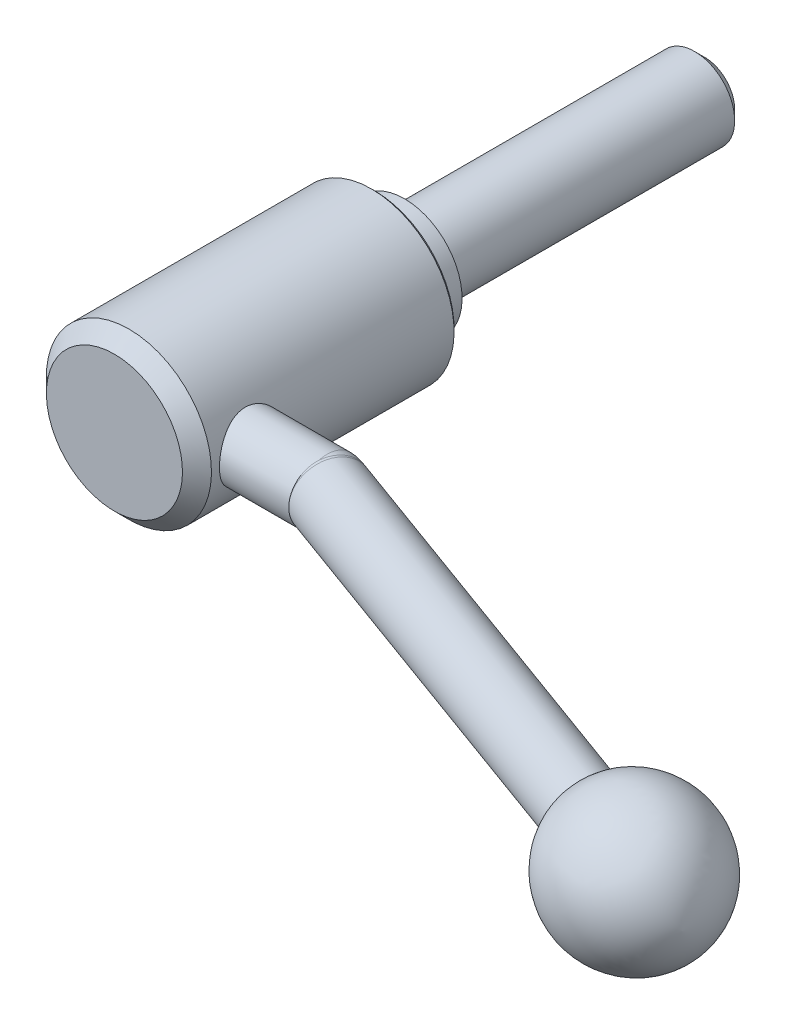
ISO-10303-21;
HEADER;
FILE_DESCRIPTION(('STEP AP214'),'2;1');
FILE_NAME('part.step','',(''),(''),'','','');
FILE_SCHEMA(('AUTOMOTIVE_DESIGN { 1 0 10303 214 1 1 1 1 }'));
ENDSEC;
DATA;
#1=APPLICATION_CONTEXT('core data for automotive mechanical design processes');
#2=APPLICATION_PROTOCOL_DEFINITION('international standard','automotive_design',2000,#1);
#3=PRODUCT_CONTEXT('',#1,'mechanical');
#4=PRODUCT('Part','Part','',(#3));
#5=PRODUCT_RELATED_PRODUCT_CATEGORY('part','',(#4));
#6=PRODUCT_DEFINITION_FORMATION('','',#4);
#7=PRODUCT_DEFINITION_CONTEXT('part definition',#1,'design');
#8=PRODUCT_DEFINITION('design','',#6,#7);
#9=PRODUCT_DEFINITION_SHAPE('','',#8);
#10=(LENGTH_UNIT() NAMED_UNIT(*) SI_UNIT(.MILLI.,.METRE.));
#11=(NAMED_UNIT(*) PLANE_ANGLE_UNIT() SI_UNIT($,.RADIAN.));
#12=(NAMED_UNIT(*) SI_UNIT($,.STERADIAN.) SOLID_ANGLE_UNIT());
#13=UNCERTAINTY_MEASURE_WITH_UNIT(LENGTH_MEASURE(1.E-05),#10,'distance_accuracy_value','');
#14=(GEOMETRIC_REPRESENTATION_CONTEXT(3) GLOBAL_UNCERTAINTY_ASSIGNED_CONTEXT((#13)) GLOBAL_UNIT_ASSIGNED_CONTEXT((#10,
#11,#12)) REPRESENTATION_CONTEXT('',''));
#15=CARTESIAN_POINT('',(0.,0.,0.));
#16=DIRECTION('',(0.,0.,1.));
#17=DIRECTION('',(1.,0.,0.));
#18=AXIS2_PLACEMENT_3D('',#15,#16,#17);
#19=CARTESIAN_POINT('',(0.,0.,0.));
#20=DIRECTION('',(0.,0.,-1.));
#21=DIRECTION('',(0.,1.,0.));
#22=AXIS2_PLACEMENT_3D('',#19,#20,#21);
#23=CYLINDRICAL_SURFACE('',#22,16.5);
#24=CARTESIAN_POINT('',(0.,0.,6.6));
#25=DIRECTION('',(0.,0.,-1.));
#26=DIRECTION('',(0.,1.,0.));
#27=AXIS2_PLACEMENT_3D('',#24,#25,#26);
#28=CIRCLE('',#27,16.5);
#29=CARTESIAN_POINT('',(0.,16.5,6.6));
#30=VERTEX_POINT('',#29);
#31=EDGE_CURVE('E147',#30,#30,#28,.T.);
#32=ORIENTED_EDGE('',*,*,#31,.F.);
#33=EDGE_LOOP('',(#32));
#34=FACE_BOUND('',#33,.T.);
#35=CARTESIAN_POINT('',(15.1657508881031,6.5,47.));
#36=CARTESIAN_POINT('',(15.1657521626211,6.49999870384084,47.1744094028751));
#37=CARTESIAN_POINT('',(15.1687696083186,6.49297069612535,47.3488754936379));
#38=CARTESIAN_POINT('',(15.180743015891,6.4649258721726,47.6965510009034));
#39=CARTESIAN_POINT('',(15.1897026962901,6.44390029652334,47.8697595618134));
#40=CARTESIAN_POINT('',(15.2132851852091,6.38802582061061,48.2139084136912));
#41=CARTESIAN_POINT('',(15.2279195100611,6.35314880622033,48.3848433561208));
#42=CARTESIAN_POINT('',(15.2623783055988,6.26991497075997,48.722930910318));
#43=CARTESIAN_POINT('',(15.2822049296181,6.22155255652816,48.890081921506));
#44=CARTESIAN_POINT('',(15.3263305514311,6.11204204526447,49.2187433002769));
#45=CARTESIAN_POINT('',(15.3506106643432,6.05094779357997,49.3802741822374));
#46=CARTESIAN_POINT('',(15.4029879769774,5.91634808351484,49.6975038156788));
#47=CARTESIAN_POINT('',(15.4310866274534,5.84283790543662,49.8532003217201));
#48=CARTESIAN_POINT('',(15.4902847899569,5.68403460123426,50.1577239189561));
#49=CARTESIAN_POINT('',(15.521382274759,5.59874941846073,50.3065555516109));
#50=CARTESIAN_POINT('',(15.5857773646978,5.41690395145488,50.5967321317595));
#51=CARTESIAN_POINT('',(15.6190757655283,5.32033957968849,50.7380743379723));
#52=CARTESIAN_POINT('',(15.6887204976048,5.11143504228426,51.0193834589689));
#53=CARTESIAN_POINT('',(15.7251359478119,4.99854682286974,51.1589265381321));
#54=CARTESIAN_POINT('',(15.7984684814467,4.76169722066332,51.4281356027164));
#55=CARTESIAN_POINT('',(15.8353855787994,4.6377355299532,51.5578013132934));
#56=CARTESIAN_POINT('',(15.9087724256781,4.37938333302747,51.8065762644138));
#57=CARTESIAN_POINT('',(15.9452419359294,4.24498750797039,51.9256800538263));
#58=CARTESIAN_POINT('',(16.0167582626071,3.96662276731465,52.1524872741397));
#59=CARTESIAN_POINT('',(16.0518055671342,3.82265718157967,52.2601946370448));
#60=CARTESIAN_POINT('',(16.1208941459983,3.52019152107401,52.467462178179));
#61=CARTESIAN_POINT('',(16.1548445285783,3.3613450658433,52.5665481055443));
#62=CARTESIAN_POINT('',(16.2192807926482,3.03521726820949,52.7508716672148));
#63=CARTESIAN_POINT('',(16.2497679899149,2.86793916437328,52.8361145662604));
#64=CARTESIAN_POINT('',(16.306415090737,2.52603369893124,52.9920322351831));
#65=CARTESIAN_POINT('',(16.3325754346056,2.35140708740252,53.062708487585));
#66=CARTESIAN_POINT('',(16.3798001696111,1.99606140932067,53.1888023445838));
#67=CARTESIAN_POINT('',(16.4008648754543,1.81534271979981,53.2442208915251));
#68=CARTESIAN_POINT('',(16.4364052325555,1.45784632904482,53.3369679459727));
#69=CARTESIAN_POINT('',(16.4511444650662,1.28128382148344,53.3750254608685));
#70=CARTESIAN_POINT('',(16.4750042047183,0.925236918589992,53.4363470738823));
#71=CARTESIAN_POINT('',(16.4841250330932,0.745752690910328,53.4596120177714));
#72=CARTESIAN_POINT('',(16.4964855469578,0.38532015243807,53.4910896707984));
#73=CARTESIAN_POINT('',(16.4997269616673,0.204372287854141,53.4993068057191));
#74=CARTESIAN_POINT('',(16.5002398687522,-0.157583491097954,53.500608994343));
#75=CARTESIAN_POINT('',(16.4975115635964,-0.33859140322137,53.4936945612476));
#76=CARTESIAN_POINT('',(16.4864766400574,-0.689328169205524,53.465606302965));
#77=CARTESIAN_POINT('',(16.4784837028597,-0.85913183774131,53.4452341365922));
#78=CARTESIAN_POINT('',(16.4574384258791,-1.19635679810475,53.3912360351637));
#79=CARTESIAN_POINT('',(16.444384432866,-1.36377729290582,53.3576057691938));
#80=CARTESIAN_POINT('',(16.4135516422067,-1.69498665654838,53.2774234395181));
#81=CARTESIAN_POINT('',(16.3957743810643,-1.85877668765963,53.2308755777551));
#82=CARTESIAN_POINT('',(16.3559249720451,-2.18179127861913,53.1252488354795));
#83=CARTESIAN_POINT('',(16.3338511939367,-2.34101407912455,53.0661651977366));
#84=CARTESIAN_POINT('',(16.2855961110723,-2.65615140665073,52.9350157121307));
#85=CARTESIAN_POINT('',(16.2593596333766,-2.81198390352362,52.8627732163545));
#86=CARTESIAN_POINT('',(16.2036445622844,-3.11704287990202,52.7064377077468));
#87=CARTESIAN_POINT('',(16.1741648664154,-3.26626708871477,52.6223406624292));
#88=CARTESIAN_POINT('',(16.1126670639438,-3.55725721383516,52.4428984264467));
#89=CARTESIAN_POINT('',(16.0806487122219,-3.69902240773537,52.3475521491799));
#90=CARTESIAN_POINT('',(16.0148235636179,-3.97435099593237,52.1462241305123));
#91=CARTESIAN_POINT('',(15.9810166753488,-4.10791397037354,52.0402418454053));
#92=CARTESIAN_POINT('',(15.9101988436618,-4.37444690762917,51.8111373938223));
#93=CARTESIAN_POINT('',(15.8731214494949,-4.50682971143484,51.687351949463));
#94=CARTESIAN_POINT('',(15.7988232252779,-4.76074389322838,51.4292307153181));
#95=CARTESIAN_POINT('',(15.7616024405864,-4.88227844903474,51.2948980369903));
#96=CARTESIAN_POINT('',(15.6879834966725,-5.11389804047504,51.0163266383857));
#97=CARTESIAN_POINT('',(15.6515859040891,-5.22397536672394,50.8720813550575));
#98=CARTESIAN_POINT('',(15.5806672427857,-5.43183822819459,50.5746385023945));
#99=CARTESIAN_POINT('',(15.5461454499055,-5.52962852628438,50.4214444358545));
#100=CARTESIAN_POINT('',(15.4790662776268,-5.71475871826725,50.1026478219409));
#101=CARTESIAN_POINT('',(15.4465879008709,-5.80174188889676,49.936821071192));
#102=CARTESIAN_POINT('',(15.3857195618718,-5.96128563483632,49.5977234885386));
#103=CARTESIAN_POINT('',(15.3573279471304,-6.03385204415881,49.4244557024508));
#104=CARTESIAN_POINT('',(15.3055990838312,-6.16388979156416,49.0716641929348));
#105=CARTESIAN_POINT('',(15.2822603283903,-6.22136563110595,48.8921423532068));
#106=CARTESIAN_POINT('',(15.2414756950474,-6.32062540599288,48.5281589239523));
#107=CARTESIAN_POINT('',(15.2240293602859,-6.36241055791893,48.3436977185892));
#108=CARTESIAN_POINT('',(15.1965377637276,-6.42778493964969,47.9824635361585));
#109=CARTESIAN_POINT('',(15.1861129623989,-6.45231123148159,47.8058886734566));
#110=CARTESIAN_POINT('',(15.1714222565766,-6.48677897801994,47.4510697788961));
#111=CARTESIAN_POINT('',(15.1671560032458,-6.4967212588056,47.2728258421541));
#112=CARTESIAN_POINT('',(15.1649343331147,-6.5019054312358,46.9161296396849));
#113=CARTESIAN_POINT('',(15.1669773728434,-6.49715091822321,46.7376774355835));
#114=CARTESIAN_POINT('',(15.1772980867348,-6.47300508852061,46.3819515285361));
#115=CARTESIAN_POINT('',(15.1855756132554,-6.45361411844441,46.2046777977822));
#116=CARTESIAN_POINT('',(15.2074545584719,-6.40187966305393,45.8623519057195));
#117=CARTESIAN_POINT('',(15.2207392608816,-6.37030447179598,45.6971624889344));
#118=CARTESIAN_POINT('',(15.2522135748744,-6.29457395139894,45.3701161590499));
#119=CARTESIAN_POINT('',(15.2704047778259,-6.25041454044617,45.2082603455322));
#120=CARTESIAN_POINT('',(15.3111508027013,-6.1499265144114,44.8889788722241));
#121=CARTESIAN_POINT('',(15.3337047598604,-6.09360031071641,44.7315523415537));
#122=CARTESIAN_POINT('',(15.3825547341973,-5.9692104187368,44.4219440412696));
#123=CARTESIAN_POINT('',(15.4088521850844,-5.90114223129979,44.2697643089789));
#124=CARTESIAN_POINT('',(15.4655807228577,-5.75087055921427,43.9656332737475));
#125=CARTESIAN_POINT('',(15.496133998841,-5.66821518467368,43.8139280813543));
#126=CARTESIAN_POINT('',(15.5596953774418,-5.4913305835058,43.5178983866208));
#127=CARTESIAN_POINT('',(15.5927043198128,-5.39709739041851,43.373576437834));
#128=CARTESIAN_POINT('',(15.6603145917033,-5.19765644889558,43.093084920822));
#129=CARTESIAN_POINT('',(15.6949161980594,-5.09244678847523,42.9569167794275));
#130=CARTESIAN_POINT('',(15.7648419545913,-4.87166967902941,42.6934495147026));
#131=CARTESIAN_POINT('',(15.8001661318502,-4.75610184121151,42.5661507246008));
#132=CARTESIAN_POINT('',(15.8732028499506,-4.50660710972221,42.3123157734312));
#133=CARTESIAN_POINT('',(15.910905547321,-4.37195833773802,42.1864851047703));
#134=CARTESIAN_POINT('',(15.985112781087,-4.09232041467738,41.9466012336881));
#135=CARTESIAN_POINT('',(16.0216176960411,-3.94733457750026,41.8325442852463));
#136=CARTESIAN_POINT('',(16.0924669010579,-3.64776716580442,41.6168903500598));
#137=CARTESIAN_POINT('',(16.1268102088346,-3.4931812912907,41.5152990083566));
#138=CARTESIAN_POINT('',(16.192362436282,-3.17548270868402,41.3254483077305));
#139=CARTESIAN_POINT('',(16.2235726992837,-3.01237370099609,41.2371832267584));
#140=CARTESIAN_POINT('',(16.2819868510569,-2.67872446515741,41.0747287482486));
#141=CARTESIAN_POINT('',(16.3091932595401,-2.50818899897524,41.0005304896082));
#142=CARTESIAN_POINT('',(16.3588360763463,-2.16084294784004,40.8668630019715));
#143=CARTESIAN_POINT('',(16.3812744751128,-1.98403501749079,40.8073876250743));
#144=CARTESIAN_POINT('',(16.4207336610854,-1.62543340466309,40.7037478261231));
#145=CARTESIAN_POINT('',(16.4377556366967,-1.44364082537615,40.6595800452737));
#146=CARTESIAN_POINT('',(16.4658759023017,-1.0764844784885,40.5870294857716));
#147=CARTESIAN_POINT('',(16.4769745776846,-0.89112094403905,40.5586456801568));
#148=CARTESIAN_POINT('',(16.4924035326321,-0.530232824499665,40.5192842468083));
#149=CARTESIAN_POINT('',(16.4971193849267,-0.354832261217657,40.5073144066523));
#150=CARTESIAN_POINT('',(16.5009342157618,-0.003578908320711,40.4976272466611));
#151=CARTESIAN_POINT('',(16.5000333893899,0.172273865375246,40.4999094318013));
#152=CARTESIAN_POINT('',(16.492639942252,0.523072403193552,40.5187002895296));
#153=CARTESIAN_POINT('',(16.4861480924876,0.698018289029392,40.5352070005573));
#154=CARTESIAN_POINT('',(16.4677497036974,1.04571908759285,40.5822707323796));
#155=CARTESIAN_POINT('',(16.4558431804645,1.21847400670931,40.6128277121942));
#156=CARTESIAN_POINT('',(16.427359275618,1.55551611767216,40.6865815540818));
#157=CARTESIAN_POINT('',(16.4109292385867,1.71990302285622,40.7293811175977));
#158=CARTESIAN_POINT('',(16.3736686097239,2.04442213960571,40.8275543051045));
#159=CARTESIAN_POINT('',(16.3528365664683,2.20455292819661,40.8829320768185));
#160=CARTESIAN_POINT('',(16.3072831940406,2.51948953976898,41.0057747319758));
#161=CARTESIAN_POINT('',(16.2825627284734,2.67429653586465,41.0732369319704));
#162=CARTESIAN_POINT('',(16.2298017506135,2.977796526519,41.2197632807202));
#163=CARTESIAN_POINT('',(16.201759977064,3.12648716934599,41.2988318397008));
#164=CARTESIAN_POINT('',(16.1417339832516,3.42320288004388,41.4716706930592));
#165=CARTESIAN_POINT('',(16.1096315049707,3.5709192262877,41.565929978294));
#166=CARTESIAN_POINT('',(16.0433028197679,3.85799821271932,41.7658374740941));
#167=CARTESIAN_POINT('',(16.0090758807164,3.99735794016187,41.8714896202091));
#168=CARTESIAN_POINT('',(15.9393375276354,4.266955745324,42.0935156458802));
#169=CARTESIAN_POINT('',(15.9038258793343,4.39719214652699,42.2098914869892));
#170=CARTESIAN_POINT('',(15.8323930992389,4.647828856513,42.4526787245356));
#171=CARTESIAN_POINT('',(15.796471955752,4.76822888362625,42.5790904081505));
#172=CARTESIAN_POINT('',(15.7229728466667,5.00544246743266,42.8491269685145));
#173=CARTESIAN_POINT('',(15.6854245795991,5.12160881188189,42.9933293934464));
#174=CARTESIAN_POINT('',(15.6119611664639,5.34135661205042,43.2913381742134));
#175=CARTESIAN_POINT('',(15.5760454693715,5.44494233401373,43.4451412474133));
#176=CARTESIAN_POINT('',(15.5068861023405,5.63889116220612,43.76158008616));
#177=CARTESIAN_POINT('',(15.4736440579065,5.72924625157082,43.9242211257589));
#178=CARTESIAN_POINT('',(15.4109193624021,5.89588782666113,44.2571658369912));
#179=CARTESIAN_POINT('',(15.3814348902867,5.9721811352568,44.427465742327));
#180=CARTESIAN_POINT('',(15.3295715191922,6.10399903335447,44.7594125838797));
#181=CARTESIAN_POINT('',(15.3067961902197,6.16075841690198,44.9205080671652));
#182=CARTESIAN_POINT('',(15.2658533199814,6.26152405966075,45.2471430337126));
#183=CARTESIAN_POINT('',(15.2476836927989,6.30553609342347,45.4126804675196));
#184=CARTESIAN_POINT('',(15.2165340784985,6.38033934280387,45.7467976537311));
#185=CARTESIAN_POINT('',(15.2035424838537,6.41116014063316,45.9153697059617));
#186=CARTESIAN_POINT('',(15.183110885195,6.45939917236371,46.2546841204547));
#187=CARTESIAN_POINT('',(15.1756675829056,6.4768253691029,46.4254251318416));
#188=CARTESIAN_POINT('',(15.1693292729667,6.49164558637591,46.6637445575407));
#189=CARTESIAN_POINT('',(15.1679883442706,6.49477751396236,46.7309454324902));
#190=CARTESIAN_POINT('',(15.1661988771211,6.49895503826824,46.8654280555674));
#191=CARTESIAN_POINT('',(15.1657503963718,6.50000050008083,46.9327098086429));
#192=CARTESIAN_POINT('',(15.1657508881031,6.5,47.));
#193=B_SPLINE_CURVE_WITH_KNOTS('',3,(#35,#36,#37,#38,#39,#40,#41,#42,#43,#44,#45,#46,#47,#48,
#49,#50,#51,#52,#53,#54,#55,#56,#57,#58,#59,#60,#61,#62,#63,#64,#65,#66,#67,#68,#69,#70,#71,#72,
#73,#74,#75,#76,#77,#78,#79,#80,#81,#82,#83,#84,#85,#86,#87,#88,#89,#90,#91,#92,#93,#94,#95,#96,
#97,#98,#99,#100,#101,#102,#103,#104,#105,#106,#107,#108,#109,#110,#111,#112,#113,#114,#115,
#116,#117,#118,#119,#120,#121,#122,#123,#124,#125,#126,#127,#128,#129,#130,#131,#132,#133,#134,
#135,#136,#137,#138,#139,#140,#141,#142,#143,#144,#145,#146,#147,#148,#149,#150,#151,#152,#153,
#154,#155,#156,#157,#158,#159,#160,#161,#162,#163,#164,#165,#166,#167,#168,#169,#170,#171,#172,
#173,#174,#175,#176,#177,#178,#179,#180,#181,#182,#183,#184,#185,#186,#187,#188,#189,#190,#191,
#192),.UNSPECIFIED.,.T.,.F.,(4,2,2,2,2,2,2,2,2,2,2,2,2,2,2,2,2,2,2,2,2,2,2,2,2,2,2,2,2,2,2,2,2,
2,2,2,2,2,2,2,2,2,2,2,2,2,2,2,2,2,2,2,2,2,2,2,2,2,2,2,2,2,2,2,2,2,2,2,2,2,2,2,2,2,2,2,2,2,4),
(0.,0.523159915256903,1.04664752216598,1.5712031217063,2.09597660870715,2.61857420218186,
3.14137090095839,3.66381663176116,4.18645228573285,4.73527747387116,5.28411792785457,
5.83324001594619,6.38217202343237,6.95226912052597,7.52214888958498,8.09197063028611,
8.66175716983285,9.20471085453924,9.74763349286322,10.2903964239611,10.8331409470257,
11.3461618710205,11.8593505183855,12.3723724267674,12.8855893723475,13.4062856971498,
13.9271595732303,14.4480838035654,14.9690346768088,15.5233891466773,16.0775806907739,
16.6321427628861,17.186489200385,17.755918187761,18.3251162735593,18.894144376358,
19.4631283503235,19.9981572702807,20.533155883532,21.0680236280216,21.6028787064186,
22.1084143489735,22.6141141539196,23.11971382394,23.6255076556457,24.1512658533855,
24.6772046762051,25.2032352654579,25.7292856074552,26.2929535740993,26.8564416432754,
27.4201839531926,27.9836835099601,28.5468269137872,29.1097347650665,29.6725190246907,
30.235266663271,30.7622239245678,31.2891628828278,31.8160291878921,32.3428939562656,
32.8542954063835,33.3658657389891,33.8773226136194,34.3889743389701,34.9228229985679,
35.4568566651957,35.990988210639,36.5251350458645,37.0912887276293,37.6572498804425,
38.2235525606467,38.7895797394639,39.3059532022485,39.8220923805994,40.3370679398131,
40.851737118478,41.0535682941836,41.2554125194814),.UNSPECIFIED.);
#194=CARTESIAN_POINT('',(15.1657508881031,6.5,47.));
#195=VERTEX_POINT('',#194);
#196=EDGE_CURVE('E77',#195,#195,#193,.T.);
#197=ORIENTED_EDGE('',*,*,#196,.F.);
#198=EDGE_LOOP('',(#197));
#199=FACE_BOUND('',#198,.T.);
#200=CARTESIAN_POINT('',(0.,0.,55.1));
#201=DIRECTION('',(0.,0.,-1.));
#202=DIRECTION('',(0.,1.,0.));
#203=AXIS2_PLACEMENT_3D('',#200,#201,#202);
#204=CIRCLE('',#203,16.5);
#205=CARTESIAN_POINT('',(0.,16.5,55.1));
#206=VERTEX_POINT('',#205);
#207=EDGE_CURVE('E149',#206,#206,#204,.T.);
#208=ORIENTED_EDGE('',*,*,#207,.T.);
#209=EDGE_LOOP('',(#208));
#210=FACE_BOUND('',#209,.T.);
#211=ADVANCED_FACE('F14',(#34,#199,#210),#23,.T.);
#212=CARTESIAN_POINT('',(0.,0.,58.));
#213=DIRECTION('',(0.,0.,-1.));
#214=DIRECTION('',(0.,1.,0.));
#215=AXIS2_PLACEMENT_3D('',#212,#213,#214);
#216=PLANE('',#215);
#217=CARTESIAN_POINT('',(0.,0.,58.));
#218=DIRECTION('',(0.,0.,-1.));
#219=DIRECTION('',(0.,1.,0.));
#220=AXIS2_PLACEMENT_3D('',#217,#218,#219);
#221=CIRCLE('',#220,13.6);
#222=CARTESIAN_POINT('',(0.,13.6,58.));
#223=VERTEX_POINT('',#222);
#224=EDGE_CURVE('E85',#223,#223,#221,.T.);
#225=ORIENTED_EDGE('',*,*,#224,.F.);
#226=EDGE_LOOP('',(#225));
#227=FACE_BOUND('',#226,.T.);
#228=ADVANCED_FACE('F61',(#227),#216,.F.);
#229=CARTESIAN_POINT('',(0.,0.,58.));
#230=DIRECTION('',(0.,0.,-1.));
#231=DIRECTION('',(0.,1.,0.));
#232=AXIS2_PLACEMENT_3D('',#229,#230,#231);
#233=CONICAL_SURFACE('',#232,13.6,0.785398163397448);
#234=ORIENTED_EDGE('',*,*,#207,.F.);
#235=EDGE_LOOP('',(#234));
#236=FACE_BOUND('',#235,.T.);
#237=ORIENTED_EDGE('',*,*,#224,.T.);
#238=EDGE_LOOP('',(#237));
#239=FACE_BOUND('',#238,.T.);
#240=ADVANCED_FACE('F67',(#236,#239),#233,.T.);
#241=CARTESIAN_POINT('',(0.,0.,6.6));
#242=DIRECTION('',(0.,0.,1.));
#243=DIRECTION('',(0.,-1.,0.));
#244=AXIS2_PLACEMENT_3D('',#241,#242,#243);
#245=CONICAL_SURFACE('',#244,16.5,0.785398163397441);
#246=CARTESIAN_POINT('',(0.,0.,6.));
#247=DIRECTION('',(0.,0.,-1.));
#248=DIRECTION('',(0.,1.,0.));
#249=AXIS2_PLACEMENT_3D('',#246,#247,#248);
#250=CIRCLE('',#249,15.9);
#251=CARTESIAN_POINT('',(0.,15.9,6.));
#252=VERTEX_POINT('',#251);
#253=EDGE_CURVE('E142',#252,#252,#250,.T.);
#254=ORIENTED_EDGE('',*,*,#253,.F.);
#255=EDGE_LOOP('',(#254));
#256=FACE_BOUND('',#255,.T.);
#257=ORIENTED_EDGE('',*,*,#31,.T.);
#258=EDGE_LOOP('',(#257));
#259=FACE_BOUND('',#258,.T.);
#260=ADVANCED_FACE('F74',(#256,#259),#245,.T.);
#261=CARTESIAN_POINT('',(15.9,0.,6.));
#262=DIRECTION('',(0.,0.,1.));
#263=DIRECTION('',(0.,-1.,0.));
#264=AXIS2_PLACEMENT_3D('',#261,#262,#263);
#265=PLANE('',#264);
#266=CARTESIAN_POINT('',(0.,0.,6.));
#267=DIRECTION('',(0.,0.,-1.));
#268=DIRECTION('',(0.,1.,0.));
#269=AXIS2_PLACEMENT_3D('',#266,#267,#268);
#270=CIRCLE('',#269,11.5);
#271=CARTESIAN_POINT('',(0.,11.5,6.));
#272=VERTEX_POINT('',#271);
#273=EDGE_CURVE('E140',#272,#272,#270,.T.);
#274=ORIENTED_EDGE('',*,*,#273,.F.);
#275=EDGE_LOOP('',(#274));
#276=FACE_BOUND('',#275,.T.);
#277=ORIENTED_EDGE('',*,*,#253,.T.);
#278=EDGE_LOOP('',(#277));
#279=FACE_BOUND('',#278,.T.);
#280=ADVANCED_FACE('F161',(#276,#279),#265,.F.);
#281=CARTESIAN_POINT('',(0.,0.,0.));
#282=DIRECTION('',(0.,0.,-1.));
#283=DIRECTION('',(0.,1.,0.));
#284=AXIS2_PLACEMENT_3D('',#281,#282,#283);
#285=CYLINDRICAL_SURFACE('',#284,11.5);
#286=CARTESIAN_POINT('',(0.,0.,0.));
#287=DIRECTION('',(0.,0.,-1.));
#288=DIRECTION('',(0.,1.,0.));
#289=AXIS2_PLACEMENT_3D('',#286,#287,#288);
#290=CIRCLE('',#289,11.5);
#291=CARTESIAN_POINT('',(0.,11.5,0.));
#292=VERTEX_POINT('',#291);
#293=EDGE_CURVE('E138',#292,#292,#290,.T.);
#294=ORIENTED_EDGE('',*,*,#293,.F.);
#295=EDGE_LOOP('',(#294));
#296=FACE_BOUND('',#295,.T.);
#297=ORIENTED_EDGE('',*,*,#273,.T.);
#298=EDGE_LOOP('',(#297));
#299=FACE_BOUND('',#298,.T.);
#300=ADVANCED_FACE('F135',(#296,#299),#285,.T.);
#301=CARTESIAN_POINT('',(11.5,0.,0.));
#302=DIRECTION('',(0.,0.,1.));
#303=DIRECTION('',(0.,-1.,0.));
#304=AXIS2_PLACEMENT_3D('',#301,#302,#303);
#305=PLANE('',#304);
#306=CARTESIAN_POINT('',(0.,0.,0.));
#307=DIRECTION('',(0.,0.,-1.));
#308=DIRECTION('',(0.,1.,0.));
#309=AXIS2_PLACEMENT_3D('',#306,#307,#308);
#310=CIRCLE('',#309,8.);
#311=CARTESIAN_POINT('',(0.,8.,0.));
#312=VERTEX_POINT('',#311);
#313=EDGE_CURVE('E126',#312,#312,#310,.T.);
#314=ORIENTED_EDGE('',*,*,#313,.F.);
#315=EDGE_LOOP('',(#314));
#316=FACE_BOUND('',#315,.T.);
#317=ORIENTED_EDGE('',*,*,#293,.T.);
#318=EDGE_LOOP('',(#317));
#319=FACE_BOUND('',#318,.T.);
#320=ADVANCED_FACE('F93',(#316,#319),#305,.F.);
#321=CARTESIAN_POINT('',(38.,0.,47.));
#322=DIRECTION('',(1.,0.,0.));
#323=DIRECTION('',(0.,1.,0.));
#324=AXIS2_PLACEMENT_3D('',#321,#322,#323);
#325=CYLINDRICAL_SURFACE('',#324,6.5);
#326=CARTESIAN_POINT('',(31.5002,-6.28048269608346,48.6749737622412));
#327=CARTESIAN_POINT('',(31.4701911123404,-6.25848550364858,48.7574684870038));
#328=CARTESIAN_POINT('',(31.4414052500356,-6.2347500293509,48.8399237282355));
#329=CARTESIAN_POINT('',(31.3859523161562,-6.18381246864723,49.0044625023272));
#330=CARTESIAN_POINT('',(31.3592849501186,-6.15661086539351,49.0865460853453));
#331=CARTESIAN_POINT('',(31.2819864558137,-6.06984393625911,49.3317442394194));
#332=CARTESIAN_POINT('',(31.234026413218,-6.00509209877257,49.4938982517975));
#333=CARTESIAN_POINT('',(31.1437652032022,-5.86212891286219,49.8135555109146));
#334=CARTESIAN_POINT('',(31.1014588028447,-5.78393016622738,49.971062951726));
#335=CARTESIAN_POINT('',(31.0215196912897,-5.61443273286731,50.2801227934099));
#336=CARTESIAN_POINT('',(30.9838873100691,-5.52313312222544,50.4316747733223));
#337=CARTESIAN_POINT('',(30.9127228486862,-5.32805112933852,50.7273614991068));
#338=CARTESIAN_POINT('',(30.8791877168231,-5.22427815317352,50.871501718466));
#339=CARTESIAN_POINT('',(30.815774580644,-5.00483968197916,51.1512875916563));
#340=CARTESIAN_POINT('',(30.7858966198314,-4.88917404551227,51.2869331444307));
#341=CARTESIAN_POINT('',(30.7295154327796,-4.64671898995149,51.548605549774));
#342=CARTESIAN_POINT('',(30.7030116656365,-4.51993135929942,51.6746339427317));
#343=CARTESIAN_POINT('',(30.6531671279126,-4.25605741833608,51.9160918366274));
#344=CARTESIAN_POINT('',(30.6298263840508,-4.1189710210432,52.0315212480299));
#345=CARTESIAN_POINT('',(30.5859306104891,-3.83395076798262,52.2520111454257));
#346=CARTESIAN_POINT('',(30.5654071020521,-3.68591886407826,52.3569512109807));
#347=CARTESIAN_POINT('',(30.527316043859,-3.38127311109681,52.5542722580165));
#348=CARTESIAN_POINT('',(30.5097495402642,-3.22465625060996,52.6466487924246));
#349=CARTESIAN_POINT('',(30.4775004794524,-2.90402878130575,52.8180456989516));
#350=CARTESIAN_POINT('',(30.4628174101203,-2.74001949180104,52.8970684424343));
#351=CARTESIAN_POINT('',(30.4362651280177,-2.40569424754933,53.0411738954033));
#352=CARTESIAN_POINT('',(30.424396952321,-2.23537599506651,53.1062514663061));
#353=CARTESIAN_POINT('',(30.4035252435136,-1.89117431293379,53.2214241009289));
#354=CARTESIAN_POINT('',(30.3944984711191,-1.71733288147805,53.2716404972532));
#355=CARTESIAN_POINT('',(30.3791416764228,-1.3658896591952,53.3574425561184));
#356=CARTESIAN_POINT('',(30.3728126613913,-1.18828648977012,53.3930227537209));
#357=CARTESIAN_POINT('',(30.3628391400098,-0.830755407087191,53.4492305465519));
#358=CARTESIAN_POINT('',(30.3591931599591,-0.650828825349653,53.4698663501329));
#359=CARTESIAN_POINT('',(30.3545680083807,-0.289765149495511,53.496061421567));
#360=CARTESIAN_POINT('',(30.3535900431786,-0.108627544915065,53.5016138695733));
#361=CARTESIAN_POINT('',(30.3542996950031,0.252555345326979,53.4975893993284));
#362=CARTESIAN_POINT('',(30.355973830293,0.432601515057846,53.4880890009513));
#363=CARTESIAN_POINT('',(30.3619660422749,0.79115770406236,53.4541833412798));
#364=CARTESIAN_POINT('',(30.3662829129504,0.969668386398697,53.429784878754));
#365=CARTESIAN_POINT('',(30.3775753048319,1.32405576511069,53.3662625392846));
#366=CARTESIAN_POINT('',(30.384552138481,1.49993111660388,53.3271313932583));
#367=CARTESIAN_POINT('',(30.4011832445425,1.84764570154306,53.2344660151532));
#368=CARTESIAN_POINT('',(30.4108365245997,2.01948640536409,53.1809371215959));
#369=CARTESIAN_POINT('',(30.4328583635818,2.35804742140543,53.0598634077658));
#370=CARTESIAN_POINT('',(30.4452278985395,2.52476586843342,52.9923135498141));
#371=CARTESIAN_POINT('',(30.4727213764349,2.85178734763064,52.843761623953));
#372=CARTESIAN_POINT('',(30.4878443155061,3.01209269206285,52.7627644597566));
#373=CARTESIAN_POINT('',(30.5209144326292,3.32526997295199,52.5879110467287));
#374=CARTESIAN_POINT('',(30.5388622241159,3.47814028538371,52.4940520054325));
#375=CARTESIAN_POINT('',(30.5776589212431,3.77530504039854,52.2942532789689));
#376=CARTESIAN_POINT('',(30.5985068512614,3.91960234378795,52.1883176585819));
#377=CARTESIAN_POINT('',(30.6433408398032,4.19941993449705,51.9645872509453));
#378=CARTESIAN_POINT('',(30.6673426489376,4.33489069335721,51.8467336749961));
#379=CARTESIAN_POINT('',(30.7185603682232,4.59531298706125,51.6005655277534));
#380=CARTESIAN_POINT('',(30.7457763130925,4.72026440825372,51.4722508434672));
#381=CARTESIAN_POINT('',(30.8036465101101,4.95882988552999,51.20617837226));
#382=CARTESIAN_POINT('',(30.8343011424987,5.07244268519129,51.0684195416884));
#383=CARTESIAN_POINT('',(30.8993555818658,5.28757920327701,50.7846019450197));
#384=CARTESIAN_POINT('',(30.9337552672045,5.38910331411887,50.6385434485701));
#385=CARTESIAN_POINT('',(31.0048466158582,5.5744837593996,50.3471450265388));
#386=CARTESIAN_POINT('',(31.0413260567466,5.65898432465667,50.2021627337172));
#387=CARTESIAN_POINT('',(31.1186048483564,5.81610839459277,49.9070309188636));
#388=CARTESIAN_POINT('',(31.1594036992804,5.88873327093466,49.7568819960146));
#389=CARTESIAN_POINT('',(31.2461889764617,6.0218129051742,49.4526179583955));
#390=CARTESIAN_POINT('',(31.2921778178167,6.08226196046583,49.2985010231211));
#391=CARTESIAN_POINT('',(31.366062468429,6.16360062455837,49.0656236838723));
#392=CARTESIAN_POINT('',(31.3915152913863,6.18916346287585,48.9876924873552));
#393=CARTESIAN_POINT('',(31.4443438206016,6.23716716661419,48.8315099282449));
#394=CARTESIAN_POINT('',(31.4717197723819,6.25960763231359,48.753258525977));
#395=CARTESIAN_POINT('',(31.5001999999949,6.28048269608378,48.6749737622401));
#396=B_SPLINE_CURVE_WITH_KNOTS('',3,(#326,#327,#328,#329,#330,#331,#332,#333,#334,#335,#336,
#337,#338,#339,#340,#341,#342,#343,#344,#345,#346,#347,#348,#349,#350,#351,#352,#353,#354,#355,
#356,#357,#358,#359,#360,#361,#362,#363,#364,#365,#366,#367,#368,#369,#370,#371,#372,#373,#374,
#375,#376,#377,#378,#379,#380,#381,#382,#383,#384,#385,#386,#387,#388,#389,#390,#391,#392,#393,
#394,#395),.UNSPECIFIED.,.F.,.F.,(4,2,2,2,2,2,2,2,2,2,2,2,2,2,2,2,2,2,2,2,2,2,2,2,2,2,2,2,2,2,2,
2,2,2,4),(0.,0.27143395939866,0.542830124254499,1.08532167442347,1.62730757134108,
2.16933170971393,2.71094964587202,3.25257402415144,3.79411146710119,4.3356534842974,
4.88283172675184,5.43020315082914,5.97747727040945,6.52495270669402,7.06782653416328,
7.61090287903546,8.15368070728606,8.69670390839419,9.23697554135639,9.77700080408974,
10.3172928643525,10.8573848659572,11.3976712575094,11.9377610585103,12.4779683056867,
13.0179942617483,13.5608276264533,14.1036668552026,14.6465661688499,15.1894478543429,
15.7040975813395,16.2186878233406,16.733518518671,16.9910761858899,17.2486667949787),.UNSPECIFIED.);
#397=CARTESIAN_POINT('',(31.5,-6.28033613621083,48.6755232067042));
#398=VERTEX_POINT('',#397);
#399=CARTESIAN_POINT('',(30.3538746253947,0.,53.5));
#400=VERTEX_POINT('',#399);
#401=EDGE_CURVE('E29',#398,#400,#396,.T.);
#402=ORIENTED_EDGE('',*,*,#401,.T.);
#403=CARTESIAN_POINT('',(31.5,6.28033613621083,48.6755232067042));
#404=VERTEX_POINT('',#403);
#405=EDGE_CURVE('E98',#400,#404,#396,.T.);
#406=ORIENTED_EDGE('',*,*,#405,.T.);
#407=CARTESIAN_POINT('',(31.5,0.,47.));
#408=DIRECTION('',(1.,0.,0.));
#409=DIRECTION('',(0.,1.,0.));
#410=AXIS2_PLACEMENT_3D('',#407,#408,#409);
#411=CIRCLE('',#410,6.5);
#412=EDGE_CURVE('E107',#398,#404,#411,.T.);
#413=ORIENTED_EDGE('',*,*,#412,.F.);
#414=EDGE_LOOP('',(#402,#406,#413));
#415=FACE_BOUND('',#414,.T.);
#416=ORIENTED_EDGE('',*,*,#196,.T.);
#417=EDGE_LOOP('',(#416));
#418=FACE_BOUND('',#417,.T.);
#419=ADVANCED_FACE('F87',(#415,#418),#325,.T.);
#420=CARTESIAN_POINT('',(31.5,0.,47.));
#421=DIRECTION('',(1.,0.,0.));
#422=DIRECTION('',(0.,0.,-1.));
#423=AXIS2_PLACEMENT_3D('',#420,#421,#422);
#424=SPHERICAL_SURFACE('',#423,6.5);
#425=CARTESIAN_POINT('',(32.0385027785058,0.,47.1959989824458));
#426=DIRECTION('',(0.939692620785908,0.,0.342020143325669));
#427=DIRECTION('',(-0.342020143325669,0.,0.939692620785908));
#428=AXIS2_PLACEMENT_3D('',#425,#426,#427);
#429=CIRCLE('',#428,6.47468911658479);
#430=EDGE_CURVE('E36',#398,#404,#429,.T.);
#431=ORIENTED_EDGE('',*,*,#430,.F.);
#432=ORIENTED_EDGE('',*,*,#412,.T.);
#433=EDGE_LOOP('',(#431,#432));
#434=FACE_BOUND('',#433,.T.);
#435=ADVANCED_FACE('F92',(#434),#424,.T.);
#436=CARTESIAN_POINT('',(32.5770055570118,0.,47.3919979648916));
#437=DIRECTION('',(0.939692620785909,0.,0.342020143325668));
#438=DIRECTION('',(-0.342020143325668,0.,0.939692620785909));
#439=AXIS2_PLACEMENT_3D('',#436,#437,#438);
#440=SPHERICAL_SURFACE('',#439,6.5);
#441=ORIENTED_EDGE('',*,*,#401,.F.);
#442=ORIENTED_EDGE('',*,*,#430,.T.);
#443=ORIENTED_EDGE('',*,*,#405,.F.);
#444=CARTESIAN_POINT('',(32.5770055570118,0.,47.3919979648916));
#445=DIRECTION('',(0.939692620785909,0.,0.342020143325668));
#446=DIRECTION('',(-0.342020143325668,0.,0.939692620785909));
#447=AXIS2_PLACEMENT_3D('',#444,#445,#446);
#448=CIRCLE('',#447,6.5);
#449=EDGE_CURVE('E105',#400,#400,#448,.T.);
#450=ORIENTED_EDGE('',*,*,#449,.F.);
#451=EDGE_LOOP('',(#441,#442,#443,#450));
#452=FACE_BOUND('',#451,.T.);
#453=ADVANCED_FACE('F109',(#452),#440,.T.);
#454=CARTESIAN_POINT('',(143.071394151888,0.,87.6086664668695));
#455=DIRECTION('',(0.939692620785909,0.,0.342020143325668));
#456=DIRECTION('',(-0.342020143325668,0.,0.939692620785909));
#457=AXIS2_PLACEMENT_3D('',#454,#455,#456);
#458=CYLINDRICAL_SURFACE('',#457,6.5);
#459=CARTESIAN_POINT('',(116.052479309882,0.,77.774585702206));
#460=DIRECTION('',(0.939692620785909,0.,0.342020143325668));
#461=DIRECTION('',(-0.342020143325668,0.,0.939692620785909));
#462=AXIS2_PLACEMENT_3D('',#459,#460,#461);
#463=CIRCLE('',#462,6.5);
#464=CARTESIAN_POINT('',(113.829348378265,0.,83.8825877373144));
#465=VERTEX_POINT('',#464);
#466=EDGE_CURVE('E121',#465,#465,#463,.T.);
#467=ORIENTED_EDGE('',*,*,#466,.F.);
#468=EDGE_LOOP('',(#467));
#469=FACE_BOUND('',#468,.T.);
#470=ORIENTED_EDGE('',*,*,#449,.T.);
#471=EDGE_LOOP('',(#470));
#472=FACE_BOUND('',#471,.T.);
#473=ADVANCED_FACE('F56',(#469,#472),#458,.T.);
#474=CARTESIAN_POINT('',(113.829348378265,0.,83.8825877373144));
#475=DIRECTION('',(0.939692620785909,0.,0.342020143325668));
#476=DIRECTION('',(-0.342020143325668,0.,0.939692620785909));
#477=AXIS2_PLACEMENT_3D('',#474,#475,#476);
#478=PLANE('',#477);
#479=CARTESIAN_POINT('',(116.052479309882,0.,77.774585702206));
#480=DIRECTION('',(0.939692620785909,0.,0.342020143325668));
#481=DIRECTION('',(-0.342020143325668,0.,0.939692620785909));
#482=AXIS2_PLACEMENT_3D('',#479,#480,#481);
#483=CIRCLE('',#482,8.37359520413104);
#484=CARTESIAN_POINT('',(113.188541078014,0.,85.6431913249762));
#485=VERTEX_POINT('',#484);
#486=EDGE_CURVE('E124',#485,#485,#483,.T.);
#487=ORIENTED_EDGE('',*,*,#486,.F.);
#488=EDGE_LOOP('',(#487));
#489=FACE_BOUND('',#488,.T.);
#490=ORIENTED_EDGE('',*,*,#466,.T.);
#491=EDGE_LOOP('',(#490));
#492=FACE_BOUND('',#491,.T.);
#493=ADVANCED_FACE('F45',(#489,#492),#478,.F.);
#494=CARTESIAN_POINT('',(128.5,0.,81.));
#495=DIRECTION('',(0.,1.,0.));
#496=DIRECTION('',(-0.342020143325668,0.,0.939692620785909));
#497=AXIS2_PLACEMENT_3D('',#494,#495,#496);
#498=CIRCLE('',#497,16.);
#499=TRIMMED_CURVE('',#498,(PARAMETER_VALUE(-1.49407077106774)),
(PARAMETER_VALUE(1.49407077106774)),.T.,.PARAMETER.);
#500=CARTESIAN_POINT('',(128.080544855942,0.,82.1524435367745));
#501=DIRECTION('',(0.939692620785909,0.,0.342020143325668));
#502=AXIS1_PLACEMENT('',#500,#501);
#503=SURFACE_OF_REVOLUTION('',#499,#502);
#504=ORIENTED_EDGE('',*,*,#486,.T.);
#505=EDGE_LOOP('',(#504));
#506=FACE_BOUND('',#505,.T.);
#507=CARTESIAN_POINT('',(143.071394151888,0.,87.6086664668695));
#508=VERTEX_POINT('',#507);
#509=VERTEX_LOOP('',#508);
#510=FACE_BOUND('',#509,.T.);
#511=ADVANCED_FACE('F42',(#506,#510),#503,.T.);
#512=CARTESIAN_POINT('',(0.,0.,23.));
#513=DIRECTION('',(0.,0.,-1.));
#514=DIRECTION('',(-1.,0.,0.));
#515=AXIS2_PLACEMENT_3D('',#512,#513,#514);
#516=CYLINDRICAL_SURFACE('',#515,8.);
#517=CARTESIAN_POINT('',(0.,0.,-58.));
#518=DIRECTION('',(0.,0.,-1.));
#519=DIRECTION('',(-1.,0.,0.));
#520=AXIS2_PLACEMENT_3D('',#517,#518,#519);
#521=CIRCLE('',#520,8.);
#522=CARTESIAN_POINT('',(-8.,0.,-58.));
#523=VERTEX_POINT('',#522);
#524=EDGE_CURVE('E9',#523,#523,#521,.F.);
#525=ORIENTED_EDGE('',*,*,#524,.T.);
#526=EDGE_LOOP('',(#525));
#527=FACE_BOUND('',#526,.T.);
#528=ORIENTED_EDGE('',*,*,#313,.T.);
#529=EDGE_LOOP('',(#528));
#530=FACE_BOUND('',#529,.T.);
#531=ADVANCED_FACE('F44',(#527,#530),#516,.T.);
#532=CARTESIAN_POINT('',(0.,0.,-60.));
#533=DIRECTION('',(0.,0.,-1.));
#534=DIRECTION('',(-1.,0.,0.));
#535=AXIS2_PLACEMENT_3D('',#532,#533,#534);
#536=PLANE('',#535);
#537=CARTESIAN_POINT('',(0.,0.,-60.));
#538=DIRECTION('',(0.,0.,-1.));
#539=DIRECTION('',(-1.,0.,0.));
#540=AXIS2_PLACEMENT_3D('',#537,#538,#539);
#541=CIRCLE('',#540,6.);
#542=CARTESIAN_POINT('',(-6.,0.,-60.));
#543=VERTEX_POINT('',#542);
#544=EDGE_CURVE('E22',#543,#543,#541,.T.);
#545=ORIENTED_EDGE('',*,*,#544,.T.);
#546=EDGE_LOOP('',(#545));
#547=FACE_BOUND('',#546,.T.);
#548=ADVANCED_FACE('F53',(#547),#536,.T.);
#549=CARTESIAN_POINT('',(0.,0.,-60.));
#550=DIRECTION('',(0.,0.,1.));
#551=DIRECTION('',(1.,0.,0.));
#552=AXIS2_PLACEMENT_3D('',#549,#550,#551);
#553=CONICAL_SURFACE('',#552,6.,0.78539816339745);
#554=ORIENTED_EDGE('',*,*,#524,.F.);
#555=EDGE_LOOP('',(#554));
#556=FACE_BOUND('',#555,.T.);
#557=ORIENTED_EDGE('',*,*,#544,.F.);
#558=EDGE_LOOP('',(#557));
#559=FACE_BOUND('',#558,.T.);
#560=ADVANCED_FACE('F16',(#556,#559),#553,.T.);
#561=CLOSED_SHELL('',(#211,#228,#240,#260,#280,#300,#320,#419,#435,#453,#473,#493,#511,#531,
#548,#560));
#562=MANIFOLD_SOLID_BREP('B1',#561);
#563=ADVANCED_BREP_SHAPE_REPRESENTATION('',(#18,#562),#14);
#564=SHAPE_DEFINITION_REPRESENTATION(#9,#563);
ENDSEC;
END-ISO-10303-21;
